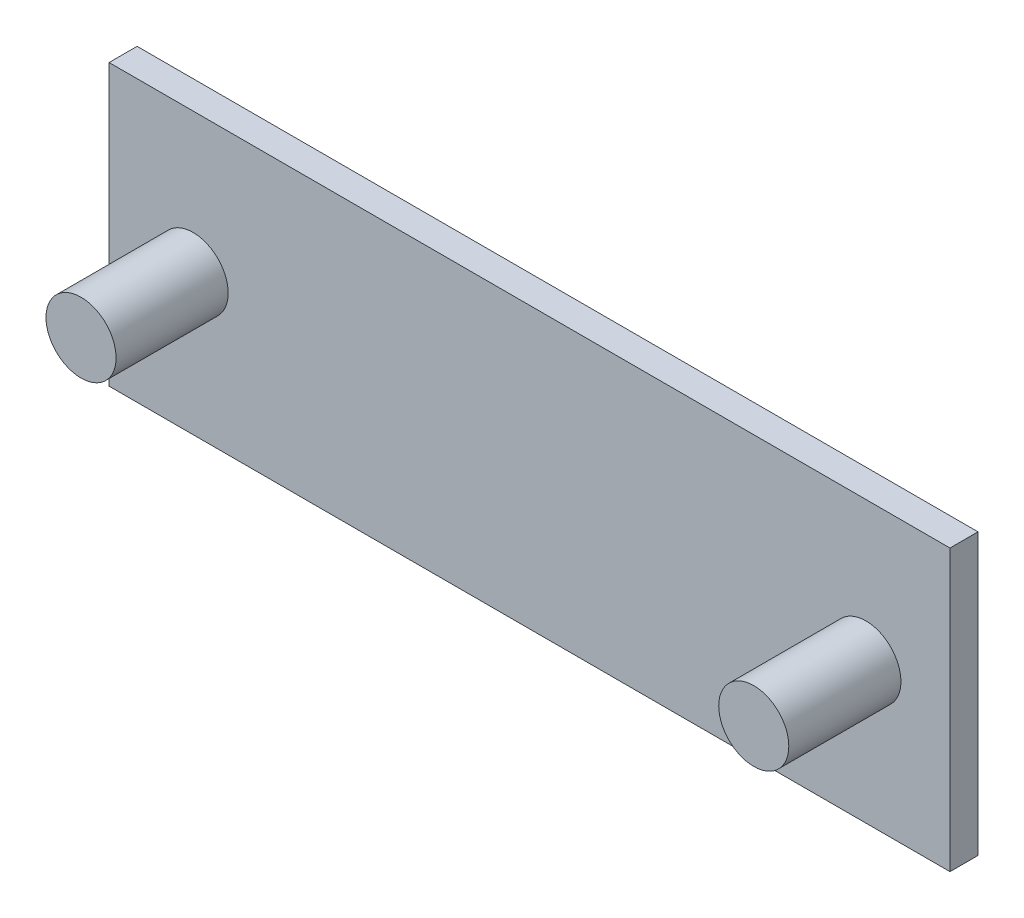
from build123d import *

# Parameters (mm, degrees)
SKIZZE1_W               = 300
SKIZZE1_H               = 100
LINEAR_AUSTRAGEN1_DEPTH = 10
SKIZZE2_R               = 12.5
LINEAR_AUSTRAGEN2_DEPTH = 40
SKIZZE3_R               = 12.5
LINEAR_AUSTRAGEN3_DEPTH = 40


with BuildPart() as part:
    # Skizze1 → Linear austragen1 (new body)
    with BuildSketch(Plane.XY):
        with Locations((150, 50)):
            Rectangle(SKIZZE1_W, SKIZZE1_H)
    extrude(amount=LINEAR_AUSTRAGEN1_DEPTH)

    # Skizze2 → Linear austragen2 (add)
    with BuildSketch(Plane.XY.offset(10)):
        with Locations(Location((30, 50, 0), (0, 0, 180))):
            Circle(SKIZZE2_R)
    extrude(amount=LINEAR_AUSTRAGEN2_DEPTH)

    # Skizze3 → Linear austragen3 (add)
    with BuildSketch(Plane.XY.offset(10)):
        with Locations(Location((270, 50, 0), (0, 0, 180))):
            Circle(SKIZZE3_R)
    extrude(amount=LINEAR_AUSTRAGEN3_DEPTH)


solid = part.part
